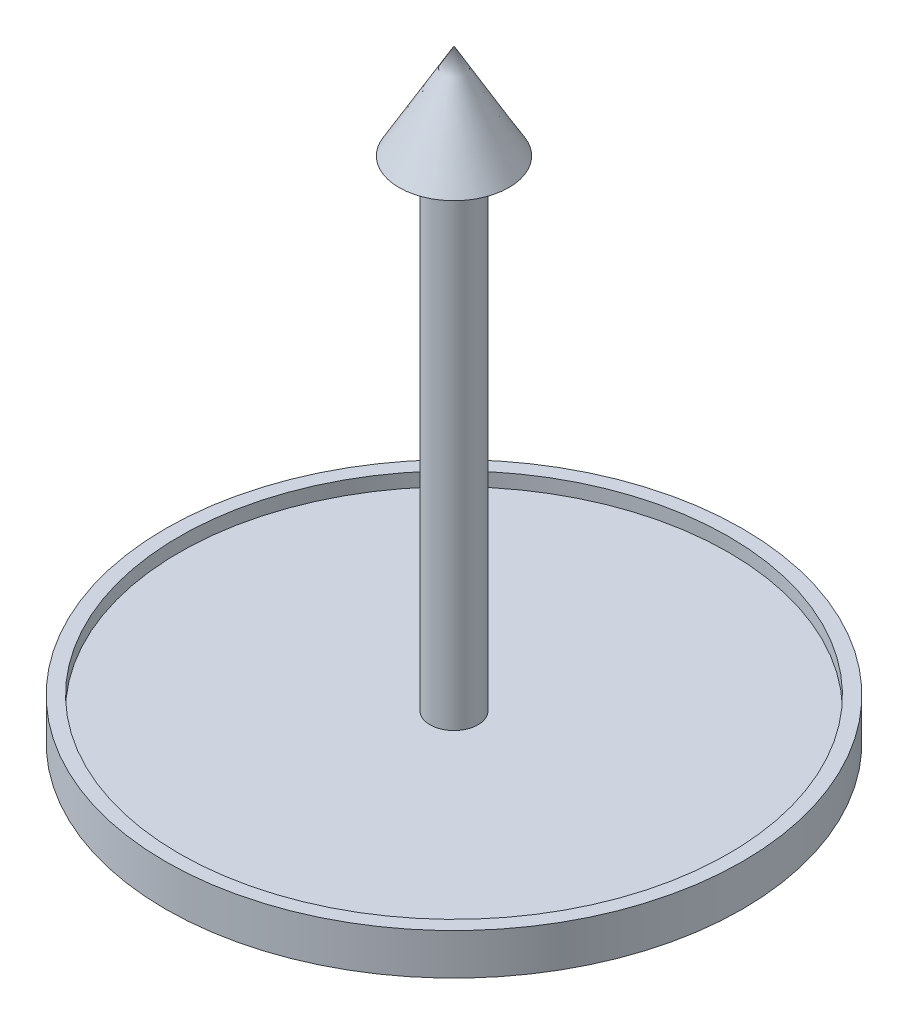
ISO-10303-21;
HEADER;
FILE_DESCRIPTION(('STEP AP214'),'2;1');
FILE_NAME('part.step','',(''),(''),'','','');
FILE_SCHEMA(('AUTOMOTIVE_DESIGN { 1 0 10303 214 1 1 1 1 }'));
ENDSEC;
DATA;
#1=APPLICATION_CONTEXT('core data for automotive mechanical design processes');
#2=APPLICATION_PROTOCOL_DEFINITION('international standard','automotive_design',2000,#1);
#3=PRODUCT_CONTEXT('',#1,'mechanical');
#4=PRODUCT('Part','Part','',(#3));
#5=PRODUCT_RELATED_PRODUCT_CATEGORY('part','',(#4));
#6=PRODUCT_DEFINITION_FORMATION('','',#4);
#7=PRODUCT_DEFINITION_CONTEXT('part definition',#1,'design');
#8=PRODUCT_DEFINITION('design','',#6,#7);
#9=PRODUCT_DEFINITION_SHAPE('','',#8);
#10=(LENGTH_UNIT() NAMED_UNIT(*) SI_UNIT(.MILLI.,.METRE.));
#11=(NAMED_UNIT(*) PLANE_ANGLE_UNIT() SI_UNIT($,.RADIAN.));
#12=(NAMED_UNIT(*) SI_UNIT($,.STERADIAN.) SOLID_ANGLE_UNIT());
#13=UNCERTAINTY_MEASURE_WITH_UNIT(LENGTH_MEASURE(1.E-05),#10,'distance_accuracy_value','');
#14=(GEOMETRIC_REPRESENTATION_CONTEXT(3) GLOBAL_UNCERTAINTY_ASSIGNED_CONTEXT((#13)) GLOBAL_UNIT_ASSIGNED_CONTEXT((#10,
#11,#12)) REPRESENTATION_CONTEXT('',''));
#15=CARTESIAN_POINT('',(0.,0.,0.));
#16=DIRECTION('',(0.,0.,1.));
#17=DIRECTION('',(1.,0.,0.));
#18=AXIS2_PLACEMENT_3D('',#15,#16,#17);
#19=CARTESIAN_POINT('',(0.,85.8564064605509,0.));
#20=DIRECTION('',(0.,-1.,0.));
#21=DIRECTION('',(0.,0.,-1.));
#22=AXIS2_PLACEMENT_3D('',#19,#20,#21);
#23=CONICAL_SURFACE('',#22,0.,0.523598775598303);
#24=CARTESIAN_POINT('',(0.,72.,0.));
#25=DIRECTION('',(0.,1.,0.));
#26=DIRECTION('',(0.,0.,1.));
#27=AXIS2_PLACEMENT_3D('',#24,#25,#26);
#28=CIRCLE('',#27,8.);
#29=CARTESIAN_POINT('',(0.,72.,8.));
#30=VERTEX_POINT('',#29);
#31=EDGE_CURVE('E13',#30,#30,#28,.T.);
#32=ORIENTED_EDGE('',*,*,#31,.T.);
#33=EDGE_LOOP('',(#32));
#34=FACE_BOUND('',#33,.T.);
#35=CARTESIAN_POINT('',(0.,85.8564064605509,0.));
#36=VERTEX_POINT('',#35);
#37=VERTEX_LOOP('',#36);
#38=FACE_BOUND('',#37,.T.);
#39=ADVANCED_FACE('F44',(#34,#38),#23,.T.);
#40=CARTESIAN_POINT('',(-3.49999999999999,72.,0.));
#41=DIRECTION('',(0.,-1.,0.));
#42=DIRECTION('',(0.,0.,-1.));
#43=AXIS2_PLACEMENT_3D('',#40,#41,#42);
#44=PLANE('',#43);
#45=CARTESIAN_POINT('',(0.,72.,0.));
#46=DIRECTION('',(0.,1.,0.));
#47=DIRECTION('',(0.,0.,1.));
#48=AXIS2_PLACEMENT_3D('',#45,#46,#47);
#49=CIRCLE('',#48,3.49999999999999);
#50=CARTESIAN_POINT('',(0.,72.,3.49999999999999));
#51=VERTEX_POINT('',#50);
#52=EDGE_CURVE('E50',#51,#51,#49,.T.);
#53=ORIENTED_EDGE('',*,*,#52,.T.);
#54=EDGE_LOOP('',(#53));
#55=FACE_BOUND('',#54,.T.);
#56=ORIENTED_EDGE('',*,*,#31,.F.);
#57=EDGE_LOOP('',(#56));
#58=FACE_BOUND('',#57,.T.);
#59=ADVANCED_FACE('F54',(#55,#58),#44,.T.);
#60=CARTESIAN_POINT('',(0.,70.5786873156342,0.));
#61=DIRECTION('',(0.,1.,0.));
#62=DIRECTION('',(0.,0.,1.));
#63=AXIS2_PLACEMENT_3D('',#60,#61,#62);
#64=CYLINDRICAL_SURFACE('',#63,3.49999999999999);
#65=CARTESIAN_POINT('',(0.,2.,0.));
#66=DIRECTION('',(0.,1.,0.));
#67=DIRECTION('',(0.,0.,1.));
#68=AXIS2_PLACEMENT_3D('',#65,#66,#67);
#69=CIRCLE('',#68,3.49999999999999);
#70=CARTESIAN_POINT('',(0.,2.,3.49999999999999));
#71=VERTEX_POINT('',#70);
#72=EDGE_CURVE('E119',#71,#71,#69,.T.);
#73=ORIENTED_EDGE('',*,*,#72,.T.);
#74=EDGE_LOOP('',(#73));
#75=FACE_BOUND('',#74,.T.);
#76=ORIENTED_EDGE('',*,*,#52,.F.);
#77=EDGE_LOOP('',(#76));
#78=FACE_BOUND('',#77,.T.);
#79=ADVANCED_FACE('F59',(#75,#78),#64,.T.);
#80=CARTESIAN_POINT('',(-40.,2.,0.));
#81=DIRECTION('',(0.,1.,0.));
#82=DIRECTION('',(0.,0.,1.));
#83=AXIS2_PLACEMENT_3D('',#80,#81,#82);
#84=PLANE('',#83);
#85=CARTESIAN_POINT('',(0.,2.,0.));
#86=DIRECTION('',(0.,1.,0.));
#87=DIRECTION('',(0.,0.,1.));
#88=AXIS2_PLACEMENT_3D('',#85,#86,#87);
#89=CIRCLE('',#88,40.);
#90=CARTESIAN_POINT('',(0.,2.,40.));
#91=VERTEX_POINT('',#90);
#92=EDGE_CURVE('E116',#91,#91,#89,.T.);
#93=ORIENTED_EDGE('',*,*,#92,.T.);
#94=EDGE_LOOP('',(#93));
#95=FACE_BOUND('',#94,.T.);
#96=ORIENTED_EDGE('',*,*,#72,.F.);
#97=EDGE_LOOP('',(#96));
#98=FACE_BOUND('',#97,.T.);
#99=ADVANCED_FACE('F66',(#95,#98),#84,.T.);
#100=CARTESIAN_POINT('',(0.,70.5786873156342,0.));
#101=DIRECTION('',(0.,1.,0.));
#102=DIRECTION('',(0.,0.,1.));
#103=AXIS2_PLACEMENT_3D('',#100,#101,#102);
#104=CYLINDRICAL_SURFACE('',#103,40.);
#105=CARTESIAN_POINT('',(0.,3.99999999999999,0.));
#106=DIRECTION('',(0.,1.,0.));
#107=DIRECTION('',(0.,0.,1.));
#108=AXIS2_PLACEMENT_3D('',#105,#106,#107);
#109=CIRCLE('',#108,40.);
#110=CARTESIAN_POINT('',(0.,3.99999999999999,40.));
#111=VERTEX_POINT('',#110);
#112=EDGE_CURVE('E113',#111,#111,#109,.T.);
#113=ORIENTED_EDGE('',*,*,#112,.T.);
#114=EDGE_LOOP('',(#113));
#115=FACE_BOUND('',#114,.T.);
#116=ORIENTED_EDGE('',*,*,#92,.F.);
#117=EDGE_LOOP('',(#116));
#118=FACE_BOUND('',#117,.T.);
#119=ADVANCED_FACE('F73',(#115,#118),#104,.F.);
#120=CARTESIAN_POINT('',(-42.,3.99999999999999,0.));
#121=DIRECTION('',(0.,1.,0.));
#122=DIRECTION('',(0.,0.,1.));
#123=AXIS2_PLACEMENT_3D('',#120,#121,#122);
#124=PLANE('',#123);
#125=CARTESIAN_POINT('',(0.,3.99999999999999,0.));
#126=DIRECTION('',(0.,1.,0.));
#127=DIRECTION('',(0.,0.,1.));
#128=AXIS2_PLACEMENT_3D('',#125,#126,#127);
#129=CIRCLE('',#128,42.);
#130=CARTESIAN_POINT('',(0.,3.99999999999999,42.));
#131=VERTEX_POINT('',#130);
#132=EDGE_CURVE('E110',#131,#131,#129,.T.);
#133=ORIENTED_EDGE('',*,*,#132,.T.);
#134=EDGE_LOOP('',(#133));
#135=FACE_BOUND('',#134,.T.);
#136=ORIENTED_EDGE('',*,*,#112,.F.);
#137=EDGE_LOOP('',(#136));
#138=FACE_BOUND('',#137,.T.);
#139=ADVANCED_FACE('F77',(#135,#138),#124,.T.);
#140=CARTESIAN_POINT('',(0.,70.5786873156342,0.));
#141=DIRECTION('',(0.,1.,0.));
#142=DIRECTION('',(0.,0.,1.));
#143=AXIS2_PLACEMENT_3D('',#140,#141,#142);
#144=CYLINDRICAL_SURFACE('',#143,42.);
#145=CARTESIAN_POINT('',(0.,-2.,0.));
#146=DIRECTION('',(0.,1.,0.));
#147=DIRECTION('',(0.,0.,1.));
#148=AXIS2_PLACEMENT_3D('',#145,#146,#147);
#149=CIRCLE('',#148,42.);
#150=CARTESIAN_POINT('',(0.,-2.,42.));
#151=VERTEX_POINT('',#150);
#152=EDGE_CURVE('E105',#151,#151,#149,.T.);
#153=ORIENTED_EDGE('',*,*,#152,.T.);
#154=EDGE_LOOP('',(#153));
#155=FACE_BOUND('',#154,.T.);
#156=ORIENTED_EDGE('',*,*,#132,.F.);
#157=EDGE_LOOP('',(#156));
#158=FACE_BOUND('',#157,.T.);
#159=ADVANCED_FACE('F81',(#155,#158),#144,.T.);
#160=CARTESIAN_POINT('',(-40.,-2.,0.));
#161=DIRECTION('',(0.,-1.,0.));
#162=DIRECTION('',(0.,0.,-1.));
#163=AXIS2_PLACEMENT_3D('',#160,#161,#162);
#164=PLANE('',#163);
#165=CARTESIAN_POINT('',(0.,-2.,0.));
#166=DIRECTION('',(0.,1.,0.));
#167=DIRECTION('',(0.,0.,1.));
#168=AXIS2_PLACEMENT_3D('',#165,#166,#167);
#169=CIRCLE('',#168,40.);
#170=CARTESIAN_POINT('',(0.,-2.,40.));
#171=VERTEX_POINT('',#170);
#172=EDGE_CURVE('E102',#171,#171,#169,.T.);
#173=ORIENTED_EDGE('',*,*,#172,.T.);
#174=EDGE_LOOP('',(#173));
#175=FACE_BOUND('',#174,.T.);
#176=ORIENTED_EDGE('',*,*,#152,.F.);
#177=EDGE_LOOP('',(#176));
#178=FACE_BOUND('',#177,.T.);
#179=ADVANCED_FACE('F85',(#175,#178),#164,.T.);
#180=CARTESIAN_POINT('',(0.,70.5786873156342,0.));
#181=DIRECTION('',(0.,1.,0.));
#182=DIRECTION('',(0.,0.,1.));
#183=AXIS2_PLACEMENT_3D('',#180,#181,#182);
#184=CYLINDRICAL_SURFACE('',#183,40.);
#185=CARTESIAN_POINT('',(0.,0.,0.));
#186=DIRECTION('',(0.,1.,0.));
#187=DIRECTION('',(0.,0.,1.));
#188=AXIS2_PLACEMENT_3D('',#185,#186,#187);
#189=CIRCLE('',#188,40.);
#190=CARTESIAN_POINT('',(0.,0.,40.));
#191=VERTEX_POINT('',#190);
#192=EDGE_CURVE('E101',#191,#191,#189,.T.);
#193=ORIENTED_EDGE('',*,*,#192,.T.);
#194=EDGE_LOOP('',(#193));
#195=FACE_BOUND('',#194,.T.);
#196=ORIENTED_EDGE('',*,*,#172,.F.);
#197=EDGE_LOOP('',(#196));
#198=FACE_BOUND('',#197,.T.);
#199=ADVANCED_FACE('F89',(#195,#198),#184,.F.);
#200=CARTESIAN_POINT('',(0.,0.,0.));
#201=DIRECTION('',(0.,-1.,0.));
#202=DIRECTION('',(0.,0.,-1.));
#203=AXIS2_PLACEMENT_3D('',#200,#201,#202);
#204=PLANE('',#203);
#205=ORIENTED_EDGE('',*,*,#192,.F.);
#206=EDGE_LOOP('',(#205));
#207=FACE_BOUND('',#206,.T.);
#208=ADVANCED_FACE('F93',(#207),#204,.T.);
#209=CLOSED_SHELL('',(#39,#59,#79,#99,#119,#139,#159,#179,#199,#208));
#210=MANIFOLD_SOLID_BREP('B2',#209);
#211=ADVANCED_BREP_SHAPE_REPRESENTATION('',(#18,#210),#14);
#212=SHAPE_DEFINITION_REPRESENTATION(#9,#211);
ENDSEC;
END-ISO-10303-21;
